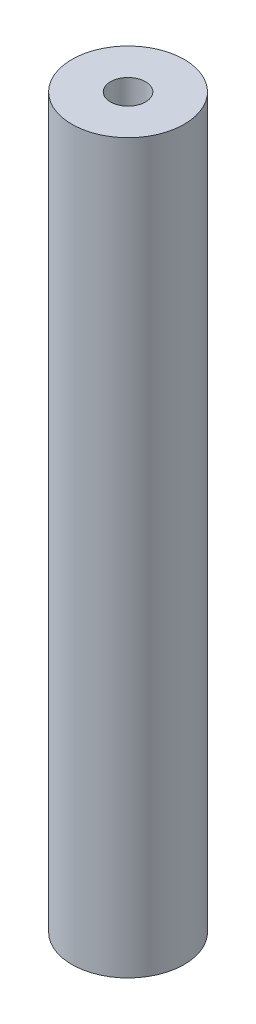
ISO-10303-21;
HEADER;
FILE_DESCRIPTION(('STEP AP214'),'2;1');
FILE_NAME('part.step','',(''),(''),'','','');
FILE_SCHEMA(('AUTOMOTIVE_DESIGN { 1 0 10303 214 1 1 1 1 }'));
ENDSEC;
DATA;
#1=APPLICATION_CONTEXT('core data for automotive mechanical design processes');
#2=APPLICATION_PROTOCOL_DEFINITION('international standard','automotive_design',2000,#1);
#3=PRODUCT_CONTEXT('',#1,'mechanical');
#4=PRODUCT('Part','Part','',(#3));
#5=PRODUCT_RELATED_PRODUCT_CATEGORY('part','',(#4));
#6=PRODUCT_DEFINITION_FORMATION('','',#4);
#7=PRODUCT_DEFINITION_CONTEXT('part definition',#1,'design');
#8=PRODUCT_DEFINITION('design','',#6,#7);
#9=PRODUCT_DEFINITION_SHAPE('','',#8);
#10=(LENGTH_UNIT() NAMED_UNIT(*) SI_UNIT(.MILLI.,.METRE.));
#11=(NAMED_UNIT(*) PLANE_ANGLE_UNIT() SI_UNIT($,.RADIAN.));
#12=(NAMED_UNIT(*) SI_UNIT($,.STERADIAN.) SOLID_ANGLE_UNIT());
#13=UNCERTAINTY_MEASURE_WITH_UNIT(LENGTH_MEASURE(1.E-05),#10,'distance_accuracy_value','');
#14=(GEOMETRIC_REPRESENTATION_CONTEXT(3) GLOBAL_UNCERTAINTY_ASSIGNED_CONTEXT((#13)) GLOBAL_UNIT_ASSIGNED_CONTEXT((#10,
#11,#12)) REPRESENTATION_CONTEXT('',''));
#15=CARTESIAN_POINT('',(0.,0.,0.));
#16=DIRECTION('',(0.,0.,1.));
#17=DIRECTION('',(1.,0.,0.));
#18=AXIS2_PLACEMENT_3D('',#15,#16,#17);
#19=CARTESIAN_POINT('',(0.,51.8,0.));
#20=DIRECTION('',(0.,-1.,0.));
#21=DIRECTION('',(0.,0.,-1.));
#22=AXIS2_PLACEMENT_3D('',#19,#20,#21);
#23=CYLINDRICAL_SURFACE('',#22,1.25);
#24=CARTESIAN_POINT('',(0.,0.,0.));
#25=DIRECTION('',(0.,1.,0.));
#26=DIRECTION('',(0.,0.,1.));
#27=AXIS2_PLACEMENT_3D('',#24,#25,#26);
#28=CIRCLE('',#27,1.25);
#29=CARTESIAN_POINT('',(0.,0.,-1.25));
#30=VERTEX_POINT('',#29);
#31=EDGE_CURVE('E54',#30,#30,#28,.T.);
#32=CARTESIAN_POINT('',(0.,15.,0.));
#33=DIRECTION('',(0.,1.,0.));
#34=DIRECTION('',(0.,0.,1.));
#35=AXIS2_PLACEMENT_3D('',#32,#33,#34);
#36=CIRCLE('',#35,1.25);
#37=CARTESIAN_POINT('',(0.,15.,-1.25));
#38=VERTEX_POINT('',#37);
#39=EDGE_CURVE('E57',#38,#38,#36,.F.);
#40=CARTESIAN_POINT('',(0.,0.,-1.25));
#41=CARTESIAN_POINT('',(0.,0.156249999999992,-1.25));
#42=CARTESIAN_POINT('',(0.,0.312499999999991,-1.25));
#43=CARTESIAN_POINT('',(0.,0.624999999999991,-1.25));
#44=CARTESIAN_POINT('',(0.,0.781249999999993,-1.25));
#45=CARTESIAN_POINT('',(0.,1.09374999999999,-1.25));
#46=CARTESIAN_POINT('',(0.,1.24999999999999,-1.25));
#47=CARTESIAN_POINT('',(0.,1.56249999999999,-1.25));
#48=CARTESIAN_POINT('',(0.,1.71874999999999,-1.25));
#49=CARTESIAN_POINT('',(0.,2.03124999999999,-1.25));
#50=CARTESIAN_POINT('',(0.,2.18749999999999,-1.25));
#51=CARTESIAN_POINT('',(0.,2.49999999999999,-1.25));
#52=CARTESIAN_POINT('',(0.,2.65624999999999,-1.25));
#53=CARTESIAN_POINT('',(0.,2.96874999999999,-1.25));
#54=CARTESIAN_POINT('',(0.,3.12499999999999,-1.25));
#55=CARTESIAN_POINT('',(0.,3.43749999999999,-1.25));
#56=CARTESIAN_POINT('',(0.,3.59375,-1.25));
#57=CARTESIAN_POINT('',(0.,3.90625,-1.25));
#58=CARTESIAN_POINT('',(0.,4.06249999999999,-1.25));
#59=CARTESIAN_POINT('',(0.,4.37499999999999,-1.25));
#60=CARTESIAN_POINT('',(0.,4.53124999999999,-1.25));
#61=CARTESIAN_POINT('',(0.,4.84374999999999,-1.25));
#62=CARTESIAN_POINT('',(0.,4.99999999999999,-1.25));
#63=CARTESIAN_POINT('',(0.,5.31249999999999,-1.25));
#64=CARTESIAN_POINT('',(0.,5.46874999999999,-1.25));
#65=CARTESIAN_POINT('',(0.,5.78124999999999,-1.25));
#66=CARTESIAN_POINT('',(0.,5.93749999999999,-1.25));
#67=CARTESIAN_POINT('',(0.,6.24999999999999,-1.25));
#68=CARTESIAN_POINT('',(0.,6.40624999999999,-1.25));
#69=CARTESIAN_POINT('',(0.,6.71874999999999,-1.25));
#70=CARTESIAN_POINT('',(0.,6.87499999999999,-1.25));
#71=CARTESIAN_POINT('',(0.,7.18749999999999,-1.25));
#72=CARTESIAN_POINT('',(0.,7.34374999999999,-1.25));
#73=CARTESIAN_POINT('',(0.,7.65624999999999,-1.25));
#74=CARTESIAN_POINT('',(0.,7.81249999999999,-1.25));
#75=CARTESIAN_POINT('',(0.,8.12499999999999,-1.25));
#76=CARTESIAN_POINT('',(0.,8.28124999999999,-1.25));
#77=CARTESIAN_POINT('',(0.,8.59374999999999,-1.25));
#78=CARTESIAN_POINT('',(0.,8.74999999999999,-1.25));
#79=CARTESIAN_POINT('',(0.,9.06249999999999,-1.25));
#80=CARTESIAN_POINT('',(0.,9.21874999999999,-1.25));
#81=CARTESIAN_POINT('',(0.,9.53124999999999,-1.25));
#82=CARTESIAN_POINT('',(0.,9.68749999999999,-1.25));
#83=CARTESIAN_POINT('',(0.,9.99999999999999,-1.25));
#84=CARTESIAN_POINT('',(0.,10.15625,-1.25));
#85=CARTESIAN_POINT('',(0.,10.46875,-1.25));
#86=CARTESIAN_POINT('',(0.,10.625,-1.25));
#87=CARTESIAN_POINT('',(0.,10.9375,-1.25));
#88=CARTESIAN_POINT('',(0.,11.09375,-1.25));
#89=CARTESIAN_POINT('',(0.,11.40625,-1.25));
#90=CARTESIAN_POINT('',(0.,11.5625,-1.25));
#91=CARTESIAN_POINT('',(0.,11.875,-1.25));
#92=CARTESIAN_POINT('',(0.,12.03125,-1.25));
#93=CARTESIAN_POINT('',(0.,12.34375,-1.25));
#94=CARTESIAN_POINT('',(0.,12.5,-1.25));
#95=CARTESIAN_POINT('',(0.,12.8125,-1.25));
#96=CARTESIAN_POINT('',(0.,12.96875,-1.25));
#97=CARTESIAN_POINT('',(0.,13.28125,-1.25));
#98=CARTESIAN_POINT('',(0.,13.4375,-1.25));
#99=CARTESIAN_POINT('',(0.,13.75,-1.25));
#100=CARTESIAN_POINT('',(0.,13.90625,-1.25));
#101=CARTESIAN_POINT('',(0.,14.21875,-1.25));
#102=CARTESIAN_POINT('',(0.,14.375,-1.25));
#103=CARTESIAN_POINT('',(0.,14.6875,-1.25));
#104=CARTESIAN_POINT('',(0.,14.84375,-1.25));
#105=CARTESIAN_POINT('',(0.,15.,-1.25));
#106=B_SPLINE_CURVE_WITH_KNOTS('',3,(#40,#41,#42,#43,#44,#45,#46,#47,#48,#49,#50,#51,#52,#53,
#54,#55,#56,#57,#58,#59,#60,#61,#62,#63,#64,#65,#66,#67,#68,#69,#70,#71,#72,#73,#74,#75,#76,#77,
#78,#79,#80,#81,#82,#83,#84,#85,#86,#87,#88,#89,#90,#91,#92,#93,#94,#95,#96,#97,#98,#99,#100,
#101,#102,#103,#104,#105),.UNSPECIFIED.,.F.,.F.,(4,2,2,2,2,2,2,2,2,2,2,2,2,2,2,2,2,2,2,2,2,2,2,
2,2,2,2,2,2,2,2,2,4),(0.,0.468749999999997,0.937500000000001,1.40625,1.875,2.34375,2.8125,
3.28125,3.75,4.21875,4.6875,5.15625,5.625,6.09375,6.5625,7.03125,7.5,7.96875,8.4375,8.90625,
9.375,9.84375,10.3125,10.78125,11.25,11.71875,12.1875,12.65625,13.125,13.59375,14.0625,14.53125,
15.),.UNSPECIFIED.);
#107=EDGE_CURVE('BSEAM36',#30,#38,#106,.T.);
#108=ORIENTED_EDGE('',*,*,#31,.F.);
#109=ORIENTED_EDGE('',*,*,#39,.F.);
#110=ORIENTED_EDGE('',*,*,#107,.T.);
#111=ORIENTED_EDGE('',*,*,#107,.F.);
#112=EDGE_LOOP('',(#108,#110,#109,#111));
#113=FACE_BOUND('',#112,.T.);
#114=ADVANCED_FACE('F36',(#113),#23,.F.);
#115=CARTESIAN_POINT('',(0.,51.8,0.));
#116=DIRECTION('',(0.,1.,0.));
#117=DIRECTION('',(0.,0.,1.));
#118=AXIS2_PLACEMENT_3D('',#115,#116,#117);
#119=PLANE('',#118);
#120=CARTESIAN_POINT('',(0.,51.8,0.));
#121=DIRECTION('',(0.,1.,0.));
#122=DIRECTION('',(0.,0.,1.));
#123=AXIS2_PLACEMENT_3D('',#120,#121,#122);
#124=CIRCLE('',#123,4.);
#125=CARTESIAN_POINT('',(0.,51.8,-4.));
#126=VERTEX_POINT('',#125);
#127=EDGE_CURVE('E43',#126,#126,#124,.T.);
#128=ORIENTED_EDGE('',*,*,#127,.T.);
#129=EDGE_LOOP('',(#128));
#130=FACE_BOUND('',#129,.T.);
#131=CARTESIAN_POINT('',(0.,51.8,0.));
#132=DIRECTION('',(0.,1.,0.));
#133=DIRECTION('',(0.,0.,1.));
#134=AXIS2_PLACEMENT_3D('',#131,#132,#133);
#135=CIRCLE('',#134,1.25);
#136=CARTESIAN_POINT('',(0.,51.8,-1.25));
#137=VERTEX_POINT('',#136);
#138=EDGE_CURVE('E52',#137,#137,#135,.T.);
#139=ORIENTED_EDGE('',*,*,#138,.F.);
#140=EDGE_LOOP('',(#139));
#141=FACE_BOUND('',#140,.T.);
#142=ADVANCED_FACE('F66',(#130,#141),#119,.T.);
#143=CARTESIAN_POINT('',(0.,0.,0.));
#144=DIRECTION('',(0.,1.,0.));
#145=DIRECTION('',(0.,0.,1.));
#146=AXIS2_PLACEMENT_3D('',#143,#144,#145);
#147=PLANE('',#146);
#148=CARTESIAN_POINT('',(0.,0.,0.));
#149=DIRECTION('',(0.,1.,0.));
#150=DIRECTION('',(0.,0.,1.));
#151=AXIS2_PLACEMENT_3D('',#148,#149,#150);
#152=CIRCLE('',#151,4.);
#153=CARTESIAN_POINT('',(0.,0.,-4.));
#154=VERTEX_POINT('',#153);
#155=EDGE_CURVE('E47',#154,#154,#152,.T.);
#156=ORIENTED_EDGE('',*,*,#155,.F.);
#157=EDGE_LOOP('',(#156));
#158=FACE_BOUND('',#157,.T.);
#159=ORIENTED_EDGE('',*,*,#31,.T.);
#160=EDGE_LOOP('',(#159));
#161=FACE_BOUND('',#160,.T.);
#162=ADVANCED_FACE('F73',(#158,#161),#147,.F.);
#163=CARTESIAN_POINT('',(0.,51.8,0.));
#164=DIRECTION('',(0.,-1.,0.));
#165=DIRECTION('',(0.,0.,-1.));
#166=AXIS2_PLACEMENT_3D('',#163,#164,#165);
#167=CYLINDRICAL_SURFACE('',#166,4.);
#168=CARTESIAN_POINT('',(0.,51.8,-4.));
#169=CARTESIAN_POINT('',(0.,51.2604166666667,-4.));
#170=CARTESIAN_POINT('',(0.,50.7208333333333,-4.));
#171=CARTESIAN_POINT('',(0.,49.6416666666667,-4.));
#172=CARTESIAN_POINT('',(0.,49.1020833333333,-4.));
#173=CARTESIAN_POINT('',(0.,48.0229166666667,-4.));
#174=CARTESIAN_POINT('',(0.,47.4833333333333,-4.));
#175=CARTESIAN_POINT('',(0.,46.4041666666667,-4.));
#176=CARTESIAN_POINT('',(0.,45.8645833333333,-4.));
#177=CARTESIAN_POINT('',(0.,44.7854166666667,-4.));
#178=CARTESIAN_POINT('',(0.,44.2458333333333,-4.));
#179=CARTESIAN_POINT('',(0.,43.1666666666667,-4.));
#180=CARTESIAN_POINT('',(0.,42.6270833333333,-4.));
#181=CARTESIAN_POINT('',(0.,41.5479166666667,-4.));
#182=CARTESIAN_POINT('',(0.,41.0083333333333,-4.));
#183=CARTESIAN_POINT('',(0.,39.9291666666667,-4.));
#184=CARTESIAN_POINT('',(0.,39.3895833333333,-4.));
#185=CARTESIAN_POINT('',(0.,38.3104166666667,-4.));
#186=CARTESIAN_POINT('',(0.,37.7708333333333,-4.));
#187=CARTESIAN_POINT('',(0.,36.6916666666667,-4.));
#188=CARTESIAN_POINT('',(0.,36.1520833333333,-4.));
#189=CARTESIAN_POINT('',(0.,35.0729166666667,-4.));
#190=CARTESIAN_POINT('',(0.,34.5333333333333,-4.));
#191=CARTESIAN_POINT('',(0.,33.4541666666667,-4.));
#192=CARTESIAN_POINT('',(0.,32.9145833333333,-4.));
#193=CARTESIAN_POINT('',(0.,31.8354166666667,-4.));
#194=CARTESIAN_POINT('',(0.,31.2958333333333,-4.));
#195=CARTESIAN_POINT('',(0.,30.2166666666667,-4.));
#196=CARTESIAN_POINT('',(0.,29.6770833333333,-4.));
#197=CARTESIAN_POINT('',(0.,28.5979166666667,-4.));
#198=CARTESIAN_POINT('',(0.,28.0583333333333,-4.));
#199=CARTESIAN_POINT('',(0.,26.9791666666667,-4.));
#200=CARTESIAN_POINT('',(0.,26.4395833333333,-4.));
#201=CARTESIAN_POINT('',(0.,25.3604166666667,-4.));
#202=CARTESIAN_POINT('',(0.,24.8208333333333,-4.));
#203=CARTESIAN_POINT('',(0.,23.7416666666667,-4.));
#204=CARTESIAN_POINT('',(0.,23.2020833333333,-4.));
#205=CARTESIAN_POINT('',(0.,22.1229166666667,-4.));
#206=CARTESIAN_POINT('',(0.,21.5833333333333,-4.));
#207=CARTESIAN_POINT('',(0.,20.5041666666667,-4.));
#208=CARTESIAN_POINT('',(0.,19.9645833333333,-4.));
#209=CARTESIAN_POINT('',(0.,18.8854166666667,-4.));
#210=CARTESIAN_POINT('',(0.,18.3458333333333,-4.));
#211=CARTESIAN_POINT('',(0.,17.2666666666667,-4.));
#212=CARTESIAN_POINT('',(0.,16.7270833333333,-4.));
#213=CARTESIAN_POINT('',(0.,15.6479166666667,-4.));
#214=CARTESIAN_POINT('',(0.,15.1083333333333,-4.));
#215=CARTESIAN_POINT('',(0.,14.0291666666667,-4.));
#216=CARTESIAN_POINT('',(0.,13.4895833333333,-4.));
#217=CARTESIAN_POINT('',(0.,12.4104166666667,-4.));
#218=CARTESIAN_POINT('',(0.,11.8708333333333,-4.));
#219=CARTESIAN_POINT('',(0.,10.7916666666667,-4.));
#220=CARTESIAN_POINT('',(0.,10.2520833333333,-4.));
#221=CARTESIAN_POINT('',(0.,9.17291666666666,-4.));
#222=CARTESIAN_POINT('',(0.,8.63333333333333,-4.));
#223=CARTESIAN_POINT('',(0.,7.55416666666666,-4.));
#224=CARTESIAN_POINT('',(0.,7.01458333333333,-4.));
#225=CARTESIAN_POINT('',(0.,5.93541666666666,-4.));
#226=CARTESIAN_POINT('',(0.,5.39583333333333,-4.));
#227=CARTESIAN_POINT('',(0.,4.31666666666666,-4.));
#228=CARTESIAN_POINT('',(0.,3.77708333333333,-4.));
#229=CARTESIAN_POINT('',(0.,2.69791666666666,-4.));
#230=CARTESIAN_POINT('',(0.,2.15833333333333,-4.));
#231=CARTESIAN_POINT('',(0.,1.07916666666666,-4.));
#232=CARTESIAN_POINT('',(0.,0.539583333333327,-4.));
#233=CARTESIAN_POINT('',(0.,0.,-4.));
#234=B_SPLINE_CURVE_WITH_KNOTS('',3,(#168,#169,#170,#171,#172,#173,#174,#175,#176,#177,#178,
#179,#180,#181,#182,#183,#184,#185,#186,#187,#188,#189,#190,#191,#192,#193,#194,#195,#196,#197,
#198,#199,#200,#201,#202,#203,#204,#205,#206,#207,#208,#209,#210,#211,#212,#213,#214,#215,#216,
#217,#218,#219,#220,#221,#222,#223,#224,#225,#226,#227,#228,#229,#230,#231,#232,#233),
.UNSPECIFIED.,.F.,.F.,(4,2,2,2,2,2,2,2,2,2,2,2,2,2,2,2,2,2,2,2,2,2,2,2,2,2,2,2,2,2,2,2,4),(0.,
1.61875,3.2375,4.85625000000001,6.475,8.09375,9.71250000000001,11.33125,12.95,14.56875,16.1875,
17.80625,19.425,21.04375,22.6625,24.28125,25.9,27.51875,29.1375,30.75625,32.375,33.99375,
35.6125,37.23125,38.85,40.46875,42.0875,43.70625,45.325,46.94375,48.5625,50.18125,51.8),.UNSPECIFIED.);
#235=EDGE_CURVE('BSEAM38',#126,#154,#234,.T.);
#236=ORIENTED_EDGE('',*,*,#127,.F.);
#237=ORIENTED_EDGE('',*,*,#155,.T.);
#238=ORIENTED_EDGE('',*,*,#235,.T.);
#239=ORIENTED_EDGE('',*,*,#235,.F.);
#240=EDGE_LOOP('',(#236,#238,#237,#239));
#241=FACE_BOUND('',#240,.T.);
#242=ADVANCED_FACE('F38',(#241),#167,.T.);
#243=CARTESIAN_POINT('',(0.,36.8,0.));
#244=DIRECTION('',(0.,1.,0.));
#245=DIRECTION('',(0.,0.,1.));
#246=AXIS2_PLACEMENT_3D('',#243,#244,#245);
#247=CIRCLE('',#246,1.25);
#248=CARTESIAN_POINT('',(0.,36.8,-1.25));
#249=VERTEX_POINT('',#248);
#250=EDGE_CURVE('E11',#249,#249,#247,.T.);
#251=CARTESIAN_POINT('',(0.,36.8,-1.25));
#252=CARTESIAN_POINT('',(0.,36.95625,-1.25));
#253=CARTESIAN_POINT('',(0.,37.1125,-1.25));
#254=CARTESIAN_POINT('',(0.,37.425,-1.25));
#255=CARTESIAN_POINT('',(0.,37.58125,-1.25));
#256=CARTESIAN_POINT('',(0.,37.89375,-1.25));
#257=CARTESIAN_POINT('',(0.,38.05,-1.25));
#258=CARTESIAN_POINT('',(0.,38.3625,-1.25));
#259=CARTESIAN_POINT('',(0.,38.51875,-1.25));
#260=CARTESIAN_POINT('',(0.,38.83125,-1.25));
#261=CARTESIAN_POINT('',(0.,38.9875,-1.25));
#262=CARTESIAN_POINT('',(0.,39.3,-1.25));
#263=CARTESIAN_POINT('',(0.,39.45625,-1.25));
#264=CARTESIAN_POINT('',(0.,39.76875,-1.25));
#265=CARTESIAN_POINT('',(0.,39.925,-1.25));
#266=CARTESIAN_POINT('',(0.,40.2375,-1.25));
#267=CARTESIAN_POINT('',(0.,40.39375,-1.25));
#268=CARTESIAN_POINT('',(0.,40.70625,-1.25));
#269=CARTESIAN_POINT('',(0.,40.8625,-1.25));
#270=CARTESIAN_POINT('',(0.,41.175,-1.25));
#271=CARTESIAN_POINT('',(0.,41.33125,-1.25));
#272=CARTESIAN_POINT('',(0.,41.64375,-1.25));
#273=CARTESIAN_POINT('',(0.,41.8,-1.25));
#274=CARTESIAN_POINT('',(0.,42.1125,-1.25));
#275=CARTESIAN_POINT('',(0.,42.26875,-1.25));
#276=CARTESIAN_POINT('',(0.,42.58125,-1.25));
#277=CARTESIAN_POINT('',(0.,42.7375,-1.25));
#278=CARTESIAN_POINT('',(0.,43.05,-1.25));
#279=CARTESIAN_POINT('',(0.,43.20625,-1.25));
#280=CARTESIAN_POINT('',(0.,43.51875,-1.25));
#281=CARTESIAN_POINT('',(0.,43.675,-1.25));
#282=CARTESIAN_POINT('',(0.,43.9875,-1.25));
#283=CARTESIAN_POINT('',(0.,44.14375,-1.25));
#284=CARTESIAN_POINT('',(0.,44.45625,-1.25));
#285=CARTESIAN_POINT('',(0.,44.6125,-1.25));
#286=CARTESIAN_POINT('',(0.,44.925,-1.25));
#287=CARTESIAN_POINT('',(0.,45.08125,-1.25));
#288=CARTESIAN_POINT('',(0.,45.39375,-1.25));
#289=CARTESIAN_POINT('',(0.,45.55,-1.25));
#290=CARTESIAN_POINT('',(0.,45.8625,-1.25));
#291=CARTESIAN_POINT('',(0.,46.01875,-1.25));
#292=CARTESIAN_POINT('',(0.,46.33125,-1.25));
#293=CARTESIAN_POINT('',(0.,46.4875,-1.25));
#294=CARTESIAN_POINT('',(0.,46.8,-1.25));
#295=CARTESIAN_POINT('',(0.,46.95625,-1.25));
#296=CARTESIAN_POINT('',(0.,47.26875,-1.25));
#297=CARTESIAN_POINT('',(0.,47.425,-1.25));
#298=CARTESIAN_POINT('',(0.,47.7375,-1.25));
#299=CARTESIAN_POINT('',(0.,47.89375,-1.25));
#300=CARTESIAN_POINT('',(0.,48.20625,-1.25));
#301=CARTESIAN_POINT('',(0.,48.3625,-1.25));
#302=CARTESIAN_POINT('',(0.,48.675,-1.25));
#303=CARTESIAN_POINT('',(0.,48.83125,-1.25));
#304=CARTESIAN_POINT('',(0.,49.14375,-1.25));
#305=CARTESIAN_POINT('',(0.,49.3,-1.25));
#306=CARTESIAN_POINT('',(0.,49.6125,-1.25));
#307=CARTESIAN_POINT('',(0.,49.76875,-1.25));
#308=CARTESIAN_POINT('',(0.,50.08125,-1.25));
#309=CARTESIAN_POINT('',(0.,50.2375,-1.25));
#310=CARTESIAN_POINT('',(0.,50.55,-1.25));
#311=CARTESIAN_POINT('',(0.,50.70625,-1.25));
#312=CARTESIAN_POINT('',(0.,51.01875,-1.25));
#313=CARTESIAN_POINT('',(0.,51.175,-1.25));
#314=CARTESIAN_POINT('',(0.,51.4875,-1.25));
#315=CARTESIAN_POINT('',(0.,51.64375,-1.25));
#316=CARTESIAN_POINT('',(0.,51.8,-1.25));
#317=B_SPLINE_CURVE_WITH_KNOTS('',3,(#251,#252,#253,#254,#255,#256,#257,#258,#259,#260,#261,
#262,#263,#264,#265,#266,#267,#268,#269,#270,#271,#272,#273,#274,#275,#276,#277,#278,#279,#280,
#281,#282,#283,#284,#285,#286,#287,#288,#289,#290,#291,#292,#293,#294,#295,#296,#297,#298,#299,
#300,#301,#302,#303,#304,#305,#306,#307,#308,#309,#310,#311,#312,#313,#314,#315,#316),
.UNSPECIFIED.,.F.,.F.,(4,2,2,2,2,2,2,2,2,2,2,2,2,2,2,2,2,2,2,2,2,2,2,2,2,2,2,2,2,2,2,2,4),(0.,
0.468750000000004,0.937500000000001,1.40625,1.875,2.34375,2.8125,3.28125000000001,3.75,4.21875,
4.6875,5.15625,5.62500000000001,6.09375,6.56250000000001,7.03125,7.5,7.96875,8.4375,8.90625,
9.375,9.84375000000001,10.3125,10.78125,11.25,11.71875,12.1875,12.65625,13.125,13.59375,14.0625,
14.53125,15.),.UNSPECIFIED.);
#318=EDGE_CURVE('BSEAM69',#249,#137,#317,.T.);
#319=ORIENTED_EDGE('',*,*,#250,.F.);
#320=ORIENTED_EDGE('',*,*,#138,.T.);
#321=ORIENTED_EDGE('',*,*,#318,.T.);
#322=ORIENTED_EDGE('',*,*,#318,.F.);
#323=EDGE_LOOP('',(#319,#321,#320,#322));
#324=FACE_BOUND('',#323,.T.);
#325=ADVANCED_FACE('F69',(#324),#23,.F.);
#326=CARTESIAN_POINT('',(0.,15.,0.));
#327=DIRECTION('',(0.,1.,0.));
#328=DIRECTION('',(0.,0.,1.));
#329=AXIS2_PLACEMENT_3D('',#326,#327,#328);
#330=PLANE('',#329);
#331=ORIENTED_EDGE('',*,*,#39,.T.);
#332=EDGE_LOOP('',(#331));
#333=FACE_BOUND('',#332,.T.);
#334=ADVANCED_FACE('F63',(#333),#330,.F.);
#335=CARTESIAN_POINT('',(0.,36.8,0.));
#336=DIRECTION('',(0.,1.,0.));
#337=DIRECTION('',(0.,0.,1.));
#338=AXIS2_PLACEMENT_3D('',#335,#336,#337);
#339=PLANE('',#338);
#340=ORIENTED_EDGE('',*,*,#250,.T.);
#341=EDGE_LOOP('',(#340));
#342=FACE_BOUND('',#341,.T.);
#343=ADVANCED_FACE('F83',(#342),#339,.T.);
#344=CLOSED_SHELL('',(#114,#142,#162,#242,#325,#334,#343));
#345=MANIFOLD_SOLID_BREP('B2',#344);
#346=ADVANCED_BREP_SHAPE_REPRESENTATION('',(#18,#345),#14);
#347=SHAPE_DEFINITION_REPRESENTATION(#9,#346);
ENDSEC;
END-ISO-10303-21;
